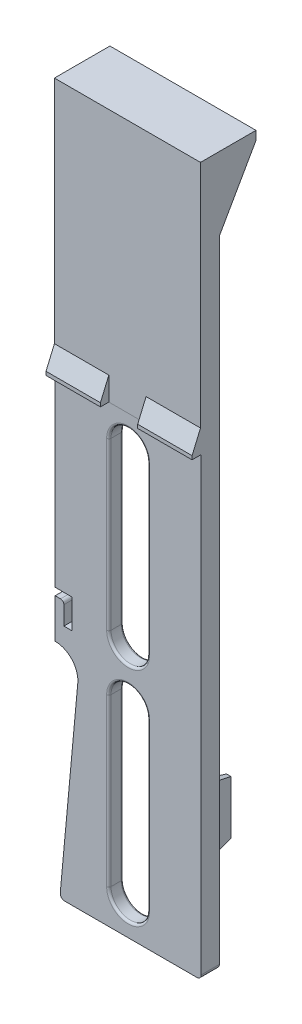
from build123d import *

# Parameters (mm, degrees)
SKETCH1_W                       = 25.4
SKETCH1_H                       = 123.19
BOSS_EXTRUDE1_DEPTH             = 2.032
SKETCH2_W                       = 25.4
SKETCH2_H                       = 123.19
SKETCH2_W_2                     = 22.352
SKETCH2_H_2                     = 120.142
EXTRUDE_THIN1_DEPTH             = 1.143
CUT_EXTRUDE1_DEPTH              = 124.883601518
LPATTERN1_COUNT                 = 2
LPATTERN1_PITCH                 = 38.608
CUT_EXTRUDE2_DEPTH              = 124.883601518
CUT_EXTRUDE2_DEPTH_BACK         = 124.883601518
CUT_EXTRUDE3_DEPTH              = 124.883601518
BOSS_EXTRUDE2_DEPTH             = 1.143
SKETCH7_W                       = 13.647669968
SKETCH7_H                       = 4.198946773
CUT_EXTRUDE4_DEPTH              = 124.883601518
CUT_EXTRUDE5_START              = -1.143
SKETCH8_R                       = 7.1374
CUT_EXTRUDE5_DEPTH              = 1.143
FILLET1_R                       = 0.254
BOSS_EXTRUDE3_DEPTH             = 0.508
BOSS_EXTRUDE4_START             = 1.143
BOSS_EXTRUDE4_DEPTH             = 1.143
SKETCH11_W                      = 1.651
SKETCH11_H                      = 49.0474
BOSS_EXTRUDE5_DEPTH             = 1.143
SKETCH12_W                      = 1.651
SKETCH12_H                      = 41.14187935
EXTRUDE_THIN4_DEPTH             = 1.143
SKETCH13_R                      = 1.392650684
SKETCH13_R_2                    = 1.442552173
BOSS_EXTRUDE6_DEPTH             = 1.143
BOSS_EXTRUDE7_DEPTH             = 1.143
FILLET2_R                       = 0.381
SKETCH15_W                      = 25.4
SKETCH15_H                      = 44.069
BOSS_EXTRUDE8_DEPTH             = 0.127
BOSS_EXTRUDE9_REACH             = 125.884
BOSS_EXTRUDE9_DIRECTION_2_REACH = 125.884
SKETCH17_W                      = 6.477
SKETCH17_H                      = 6.214678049
CUT_EXTRUDE6_DEPTH              = 124.883601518
FILLET3_R                       = 0.5842
SKETCH18_W                      = 1.651
SKETCH18_H                      = 12.7
BOSS_EXTRUDE11_DEPTH            = 6.35
BOSS_EXTRUDE11_TAPER            = 4
CUT_EXTRUDE7_DEPTH              = 127.141435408
FILLET4_R                       = 0.762
CUT_EXTRUDE8_DEPTH              = 125.208662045
CUT_EXTRUDE8_DEPTH_BACK         = 125.208662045
BOSS_EXTRUDE12_DEPTH            = 6.35
CUT_EXTRUDE9_DEPTH              = 127.141435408


with BuildPart() as part:
    # Sketch1 → Boss-Extrude1 (new body)
    with BuildSketch(Plane.XY):
        with Locations((0, 61.595)):
            Rectangle(SKETCH1_W, SKETCH1_H)
    extrude(amount=-BOSS_EXTRUDE1_DEPTH)

    # Sketch2 → Extrude-Thin1 (add)
    with BuildSketch(Plane(origin=(0, 0, -2.032), x_dir=(-1, 0, 0), z_dir=(0, 0, -1))):
        with Locations((0, 61.595)):
            Rectangle(SKETCH2_W, SKETCH2_H)
        with Locations((0, 61.595)):
            Rectangle(SKETCH2_W_2, SKETCH2_H_2, mode=Mode.SUBTRACT)
    extrude(amount=EXTRUDE_THIN1_DEPTH)

    # Sketch3 → Cut-Extrude1 (cut, through all)
    with BuildSketch(Plane.XY):
        with BuildLine():
            Line((3.3655, 34.7345), (3.3655, 5.8293))
            ThreePointArc((3.3655, 5.8293), (0, 2.4638), (-3.3655, 5.8293))
            Line((-3.3655, 5.8293), (-3.3655, 34.7345))
            ThreePointArc((-3.3655, 34.7345), (0, 38.1), (3.3655, 34.7345))
        make_face()
    cut_extrude1 = extrude(amount=-CUT_EXTRUDE1_DEPTH, mode=Mode.SUBTRACT)

    # LPattern1: Cut-Extrude1 ×2
    with Locations(*[(0, i * LPATTERN1_PITCH, 0) for i in range(1, LPATTERN1_COUNT)]):
        add(cut_extrude1, mode=Mode.SUBTRACT)

    # Sketch4 → Cut-Extrude2 (cut, two sides: drawn at the far end of the back side and taken through both)
    with BuildSketch(Plane.XY.offset(-CUT_EXTRUDE2_DEPTH_BACK)):
        with BuildLine():
            Line((-35.799894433, -260.142646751), (-11.8872, 0))
            Line((-11.8872, 0), (-8.763, 33.987707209))
            ThreePointArc((-8.763, 33.987707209), (-9.7792361, 37.014198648), (-12.7, 38.3032))
            Line((-12.7, 38.3032), (-273.939379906, 38.3032))
            Line((-273.939379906, 38.3032), (-682.338410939, -287.571447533))
            Line((-682.338410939, -287.571447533), (-444.198925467, -586.017294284))
            Line((-444.198925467, -586.017294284), (-35.799894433, -260.142646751))
        make_face()
    extrude(amount=CUT_EXTRUDE2_DEPTH + CUT_EXTRUDE2_DEPTH_BACK, mode=Mode.SUBTRACT)

    # Sketch5 → Cut-Extrude3 (cut, through all)
    with BuildSketch(Plane.XY):
        Polygon((-12.7, 46.4312), (-9.7282, 46.4312), (-9.7282, 41.3512), (-11.176, 41.3512), (-11.176, 45.1612), (-12.7, 45.1612), align=None)
    extrude(amount=-CUT_EXTRUDE3_DEPTH, mode=Mode.SUBTRACT)

    # Sketch6 → Boss-Extrude2 (add)
    with BuildSketch(Plane(origin=(0, 0, -2.032), x_dir=(-1, 0, 0), z_dir=(0, 0, -1))):
        with BuildLine():
            Line((-8.7884, 6.08076), (-8.7884, 72.6186))
            ThreePointArc((-8.7884, 72.6186), (0, 81.407), (8.7884, 72.6186))
            Line((8.7884, 72.6186), (8.7884, 6.08076))
            ThreePointArc((8.7884, 6.08076), (0, -2.70764), (-8.7884, 6.08076))
        make_face()
        with BuildLine():
            Line((-7.1374, 6.08076), (-7.1374, 72.6186))
            ThreePointArc((-7.1374, 72.6186), (0, 79.756), (7.1374, 72.6186))
            Line((7.1374, 72.6186), (7.1374, 6.08076))
            ThreePointArc((7.1374, 6.08076), (0, -1.05664), (-7.1374, 6.08076))
        make_face(mode=Mode.SUBTRACT)
    extrude(amount=BOSS_EXTRUDE2_DEPTH)

    # Sketch7 → Cut-Extrude4 (cut, through all)
    with BuildSketch(Plane(origin=(0, 0, -3.175), x_dir=(-1, 0, 0), z_dir=(0, 0, -1))):
        with Locations((0.47873196, -2.099473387)):
            Rectangle(SKETCH7_W, SKETCH7_H)
    extrude(amount=-CUT_EXTRUDE4_DEPTH, mode=Mode.SUBTRACT)

    # Sketch8 → Cut-Extrude5 (cut)
    with BuildSketch(Plane(origin=(0, 0, -3.175), x_dir=(-1, 0, 0), z_dir=(0, 0, -1)).offset(CUT_EXTRUDE5_START)):
        with Locations((0, 6.08076)):
            Circle(SKETCH8_R)
    extrude(amount=CUT_EXTRUDE5_DEPTH, mode=Mode.SUBTRACT)

    # Fillet1
    fillet1_edges = [part.edges().sort_by_distance(p)[0] for p in [
        (-3.737223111, 0, -2.6035),
        (3.737223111, 0, -2.6035),
    ]]
    fillet(fillet1_edges, radius=FILLET1_R)

    # Sketch9 → Boss-Extrude3 (add)
    with BuildSketch(Plane(origin=(0, 0, -2.032), x_dir=(-1, 0, 0), z_dir=(0, 0, -1))):
        with BuildLine():
            Line((-7.1374, 72.6186), (-7.1374, 6.08076))
            ThreePointArc((-7.1374, 6.08076), (-6.414276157, 2.950338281), (-4.391430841, 0.454232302))
            ThreePointArc((-4.391430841, 0.454232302), (-4.307527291, 0.171365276), (-4.547709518, 0))
            Line((-4.547709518, 0), (4.547709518, 0))
            ThreePointArc((4.547709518, 0), (4.307527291, 0.171365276), (4.391430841, 0.454232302))
            ThreePointArc((4.391430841, 0.454232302), (6.414276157, 2.950338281), (7.1374, 6.08076))
            Line((7.1374, 6.08076), (7.1374, 72.6186))
            ThreePointArc((7.1374, 72.6186), (0, 79.756), (-7.1374, 72.6186))
        make_face()
        with BuildLine():
            Line((3.3655, 34.7345), (3.3655, 5.8293))
            ThreePointArc((3.3655, 5.8293), (0, 2.4638), (-3.3655, 5.8293))
            Line((-3.3655, 5.8293), (-3.3655, 34.7345))
            ThreePointArc((-3.3655, 34.7345), (0, 38.1), (3.3655, 34.7345))
        make_face(mode=Mode.SUBTRACT)
        with BuildLine():
            Line((-3.3655, 44.4373), (-3.3655, 73.3425))
            ThreePointArc((-3.3655, 73.3425), (0, 76.708), (3.3655, 73.3425))
            Line((3.3655, 73.3425), (3.3655, 44.4373))
            ThreePointArc((3.3655, 44.4373), (0, 41.0718), (-3.3655, 44.4373))
        make_face(mode=Mode.SUBTRACT)
    extrude(amount=BOSS_EXTRUDE3_DEPTH)

    # Sketch10 → Boss-Extrude4 (add)
    with BuildSketch(Plane(origin=(0, 0, -2.032), x_dir=(-1, 0, 0), z_dir=(0, 0, -1)).offset(BOSS_EXTRUDE4_START)):
        with BuildLine():
            Line((8.7884, 34.924338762), (8.7884, 48.0822))
            Line((8.7884, 48.0822), (11.176, 48.0822))
            Line((11.176, 48.0822), (11.176, 46.4312))
            Line((11.176, 46.4312), (9.7282, 46.4312))
            Line((9.7282, 46.4312), (9.7282, 41.3512))
            Line((9.7282, 41.3512), (11.176, 41.3512))
            Line((11.176, 41.3512), (11.176, 37.997664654))
            ThreePointArc((11.176, 37.997664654), (9.577858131, 36.775126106), (8.7884, 34.924338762))
        make_face()
    extrude(amount=-BOSS_EXTRUDE4_DEPTH)

    # Sketch11 → Boss-Extrude5 (add)
    with BuildSketch(Plane(origin=(0, 0, -2.032), x_dir=(-1, 0, 0), z_dir=(0, 0, -1))):
        with Locations((7.9629, 97.1423)):
            Rectangle(SKETCH11_W, SKETCH11_H)
        with Locations((-7.9629, 97.1423)):
            Rectangle(SKETCH11_W, SKETCH11_H)
    extrude(amount=BOSS_EXTRUDE5_DEPTH)

    # Sketch12 → Extrude-Thin4 (add)
    with BuildSketch(Plane(origin=(0, 0, -2.032), x_dir=(-1, 0, 0), z_dir=(0, 0, -1))):
        with Locations((0, 101.095060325)):
            Rectangle(SKETCH12_W, SKETCH12_H)
    extrude(amount=EXTRUDE_THIN4_DEPTH)

    # Sketch13 → Boss-Extrude6 (add)
    with BuildSketch(Plane(origin=(0, 0, -2.032), x_dir=(-1, 0, 0), z_dir=(0, 0, -1))):
        with Locations((9.9822, 50.83075695)):
            Circle(SKETCH13_R)
        with Locations((-10.083369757, 49.882820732)):
            Circle(SKETCH13_R_2)
    extrude(amount=BOSS_EXTRUDE6_DEPTH)

    # Sketch14 → Boss-Extrude7 (add)
    with BuildSketch(Plane(origin=(0, 0, -2.032), x_dir=(-1, 0, 0), z_dir=(0, 0, -1))):
        with BuildLine():
            Line((7.514779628, 1.524), (11.176, 1.524))
            Line((11.176, 1.524), (11.176, 7.737039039))
            Line((11.176, 7.737039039), (8.7884, 33.711384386))
            Line((8.7884, 33.711384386), (8.7884, 6.08076))
            ThreePointArc((8.7884, 6.08076), (8.464008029, 3.715058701), (7.514779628, 1.524))
        make_face()
    extrude(amount=BOSS_EXTRUDE7_DEPTH)

    # Fillet2
    fillet2_edges = [part.edges().sort_by_distance(p)[0] for p in [
        (0, 2.4638, -2.54),
        (-3.3655, 20.2819, -2.54),
        (0, 38.1, -2.54),
        (3.3655, 20.2819, -2.54),
        (0, 41.0718, -2.54),
        (-3.3655, 58.8899, -2.54),
        (0, 76.708, -2.54),
        (3.3655, 58.8899, -2.54),
        (0, 38.1, 0),
        (-3.3655, 20.2819, 0),
        (0, 2.4638, 0),
        (3.3655, 20.2819, 0),
        (0, 76.708, 0),
        (-3.3655, 58.8899, 0),
        (0, 41.0718, 0),
        (3.3655, 58.8899, 0),
    ]]
    fillet(fillet2_edges, radius=FILLET2_R)

    # Sketch15 → Boss-Extrude8 (add)
    with BuildSketch(Plane.XY):
        with Locations((0, 101.1555)):
            Rectangle(SKETCH15_W, SKETCH15_H)
    extrude(amount=BOSS_EXTRUDE8_DEPTH)

    # Boss-Extrude9: up to this face of the body (flat: up to its plane)
    boss_extrude9_end = Plane(part.part.faces().sort_by_distance((12.7, 62.153096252, -1.564208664))[0])
    # Sketch16 → Boss-Extrude9 (add, up to the picked face)
    with BuildSketch(Plane(origin=(0, 0, 0), x_dir=(0, 0, -1), z_dir=(1, 0, 0)), mode=Mode.PRIVATE) as boss_extrude9_sk1:
        Polygon((-0.127, 79.121), (-1.5875, 79.121), (-1.5875, 79.756), (-0.127, 83.185), align=None)
    boss_extrude9_tool1 = split(extrude(boss_extrude9_sk1.sketch, amount=BOSS_EXTRUDE9_REACH, mode=Mode.PRIVATE), bisect_by=boss_extrude9_end, keep=Keep.BOTH, mode=Mode.PRIVATE)
    add(boss_extrude9_tool1.solids().sort_by(Axis((0, 80.50427, 0.679622), (1, 0, 0)))[0])

    # Boss-Extrude9 direction 2: up to this face of the body (flat: up to its plane)
    boss_extrude9_direction_2_end = Plane(part.part.faces().sort_by_distance((-12.7, 85.177532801, -1.550436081))[0])
    # Sketch16 → Boss-Extrude9 direction 2 (add, up to the picked face)
    with BuildSketch(Plane(origin=(0, 0, 0), x_dir=(0, 0, -1), z_dir=(1, 0, 0)), mode=Mode.PRIVATE) as boss_extrude9_direction_2_sk1:
        Polygon((-0.127, 79.121), (-1.5875, 79.121), (-1.5875, 79.756), (-0.127, 83.185), align=None)
    boss_extrude9_direction_2_tool1 = split(extrude(boss_extrude9_direction_2_sk1.sketch, amount=-BOSS_EXTRUDE9_DIRECTION_2_REACH, mode=Mode.PRIVATE), bisect_by=boss_extrude9_direction_2_end, keep=Keep.BOTH, mode=Mode.PRIVATE)
    add(boss_extrude9_direction_2_tool1.solids().sort_by(Axis((0, 80.50427, 0.679622), (-1, 0, 0)))[0])

    # Sketch17 → Cut-Extrude6 (cut, through all)
    with BuildSketch(Plane(origin=(0, 123.19, 0), x_dir=(1, 0, 0), z_dir=(0, 1, 0))):
        with Locations((0, -3.234339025)):
            Rectangle(SKETCH17_W, SKETCH17_H)
    extrude(amount=-CUT_EXTRUDE6_DEPTH, mode=Mode.SUBTRACT)

    # Fillet3
    fillet3_edges = [part.edges().sort_by_distance(p)[0] for p in [
        (-11.176, 45.1612, -1.5875),
    ]]
    fillet(fillet3_edges, radius=FILLET3_R)

    # Sketch18 → Boss-Extrude11 (add)
    with BuildSketch(Plane(origin=(0, 0, -3.175), x_dir=(-1, 0, 0), z_dir=(0, 0, -1))):
        with Locations((-7.9629, 19.05)):
            Rectangle(SKETCH18_W, SKETCH18_H)
    extrude(amount=BOSS_EXTRUDE11_DEPTH, taper=BOSS_EXTRUDE11_TAPER)

    # Sketch19 → Cut-Extrude7 (cut, through all)
    with BuildSketch(Plane(origin=(12.7, 0, 0), x_dir=(0, 0, -1), z_dir=(1, 0, 0))):
        Polygon((3.175, 12.7), (12.912641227, 12.7), (11.269528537, 14.868922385), align=None)
        Polygon((3.175, 25.4), (14.802583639, 25.4), (12.714688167, 22.84384826), align=None)
    extrude(amount=-CUT_EXTRUDE7_DEPTH, mode=Mode.SUBTRACT)

    # Fillet4
    fillet4_edges = [part.edges().sort_by_distance(p)[0] for p in [
        (12.7, 0, -1.5875),
        (-11.8872, 0, -1.5875),
    ]]
    fillet(fillet4_edges, radius=FILLET4_R)

    # Sketch20 → Cut-Extrude8 (cut, two sides: drawn at the far end of the back side and taken through both)
    with BuildSketch(Plane.XY.offset(-CUT_EXTRUDE8_DEPTH_BACK)):
        with BuildLine():
            Line((-272.278187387, 38.3032), (-12.7, 38.3032))
            ThreePointArc((-12.7, 38.3032), (-9.7792361, 37.014198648), (-8.763, 33.987707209))
            Line((-8.763, 33.987707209), (-11.810744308, 0.831750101))
            Line((-11.810744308, 0.831750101), (-35.571380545, -257.656678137))
            Line((-35.571380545, -257.656678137), (-441.005224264, -581.920058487))
            Line((-441.005224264, -581.920058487), (-677.712031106, -285.96018035))
            Line((-677.712031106, -285.96018035), (-272.278187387, 38.3032))
        make_face()
    extrude(amount=CUT_EXTRUDE8_DEPTH + CUT_EXTRUDE8_DEPTH_BACK, mode=Mode.SUBTRACT)

    # Sketch22 → Boss-Extrude12 (add)
    with BuildSketch(Plane(origin=(0, 0, -3.175), x_dir=(-1, 0, 0), z_dir=(0, 0, -1))):
        Polygon((-12.7, 123.19), (12.7, 123.19), (12.7, 110.49), (11.176, 110.49), (11.176, 121.666), (8.7884, 121.666), (8.7884, 110.49), (7.1374, 110.49), (7.1374, 121.666), (0.8255, 121.666), (0.8255, 110.49), (-0.8255, 110.49), (-0.8255, 121.666), (-7.1374, 121.666), (-7.1374, 110.49), (-8.7884, 110.49), (-8.7884, 121.666), (-11.176, 121.666), (-11.176, 110.49), (-12.7, 110.49), align=None)
    extrude(amount=BOSS_EXTRUDE12_DEPTH)

    # Sketch23 → Cut-Extrude9 (cut, through all)
    with BuildSketch(Plane.ZY.offset(12.7)):
        Polygon((-3.175, 110.49), (-9.525, 121.666), (-9.525, 110.49), align=None)
    extrude(amount=-CUT_EXTRUDE9_DEPTH, mode=Mode.SUBTRACT)


solid = part.part
